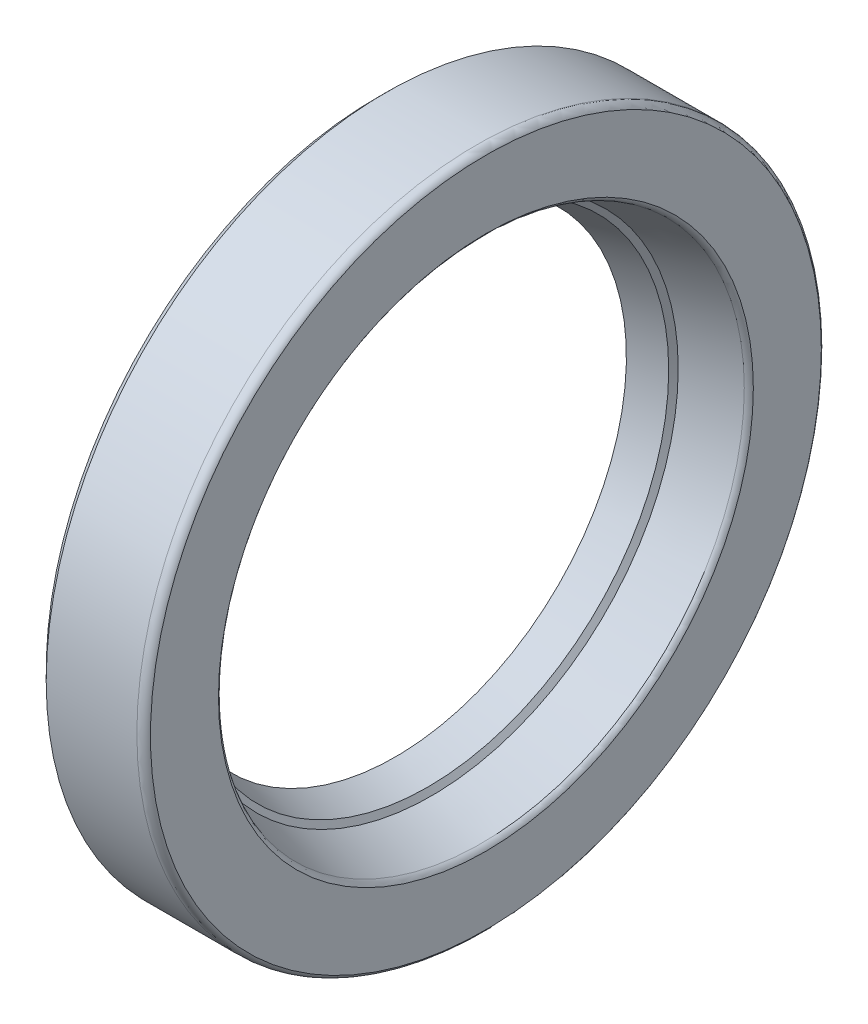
ISO-10303-21;
HEADER;
FILE_DESCRIPTION(('STEP AP214'),'2;1');
FILE_NAME('part.step','',(''),(''),'','','');
FILE_SCHEMA(('AUTOMOTIVE_DESIGN { 1 0 10303 214 1 1 1 1 }'));
ENDSEC;
DATA;
#1=APPLICATION_CONTEXT('core data for automotive mechanical design processes');
#2=APPLICATION_PROTOCOL_DEFINITION('international standard','automotive_design',2000,#1);
#3=PRODUCT_CONTEXT('',#1,'mechanical');
#4=PRODUCT('Part','Part','',(#3));
#5=PRODUCT_RELATED_PRODUCT_CATEGORY('part','',(#4));
#6=PRODUCT_DEFINITION_FORMATION('','',#4);
#7=PRODUCT_DEFINITION_CONTEXT('part definition',#1,'design');
#8=PRODUCT_DEFINITION('design','',#6,#7);
#9=PRODUCT_DEFINITION_SHAPE('','',#8);
#10=(LENGTH_UNIT() NAMED_UNIT(*) SI_UNIT(.MILLI.,.METRE.));
#11=(NAMED_UNIT(*) PLANE_ANGLE_UNIT() SI_UNIT($,.RADIAN.));
#12=(NAMED_UNIT(*) SI_UNIT($,.STERADIAN.) SOLID_ANGLE_UNIT());
#13=UNCERTAINTY_MEASURE_WITH_UNIT(LENGTH_MEASURE(1.E-05),#10,'distance_accuracy_value','');
#14=(GEOMETRIC_REPRESENTATION_CONTEXT(3) GLOBAL_UNCERTAINTY_ASSIGNED_CONTEXT((#13)) GLOBAL_UNIT_ASSIGNED_CONTEXT((#10,
#11,#12)) REPRESENTATION_CONTEXT('',''));
#15=CARTESIAN_POINT('',(0.,0.,0.));
#16=DIRECTION('',(0.,0.,1.));
#17=DIRECTION('',(1.,0.,0.));
#18=AXIS2_PLACEMENT_3D('',#15,#16,#17);
#19=CARTESIAN_POINT('',(1.,0.,0.));
#20=DIRECTION('',(1.,0.,0.));
#21=DIRECTION('',(0.,0.,-1.));
#22=AXIS2_PLACEMENT_3D('',#19,#20,#21);
#23=TOROIDAL_SURFACE('',#22,9.5,0.5);
#24=CARTESIAN_POINT('',(0.782055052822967,0.,0.));
#25=DIRECTION('',(1.,0.,0.));
#26=DIRECTION('',(0.,0.,-1.));
#27=AXIS2_PLACEMENT_3D('',#24,#25,#26);
#28=CIRCLE('',#27,9.95);
#29=CARTESIAN_POINT('',(0.782055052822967,0.,-9.95));
#30=VERTEX_POINT('',#29);
#31=EDGE_CURVE('E53',#30,#30,#28,.F.);
#32=ORIENTED_EDGE('',*,*,#31,.F.);
#33=EDGE_LOOP('',(#32));
#34=FACE_BOUND('',#33,.T.);
#35=CARTESIAN_POINT('',(1.48640310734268,0.,0.));
#36=DIRECTION('',(1.,0.,0.));
#37=DIRECTION('',(0.,1.,0.));
#38=AXIS2_PLACEMENT_3D('',#35,#36,#37);
#39=CIRCLE('',#38,9.61581026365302);
#40=CARTESIAN_POINT('',(1.48640310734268,9.61581026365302,0.));
#41=VERTEX_POINT('',#40);
#42=EDGE_CURVE('E30',#41,#41,#39,.T.);
#43=ORIENTED_EDGE('',*,*,#42,.F.);
#44=EDGE_LOOP('',(#43));
#45=FACE_BOUND('',#44,.T.);
#46=ADVANCED_FACE('F14',(#34,#45),#23,.T.);
#47=CARTESIAN_POINT('',(2.4,0.,0.));
#48=DIRECTION('',(1.,0.,0.));
#49=DIRECTION('',(0.,0.,-1.));
#50=AXIS2_PLACEMENT_3D('',#47,#48,#49);
#51=CONICAL_SURFACE('',#50,9.83333333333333,0.233743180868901);
#52=CARTESIAN_POINT('',(2.4,0.,0.));
#53=DIRECTION('',(1.,0.,0.));
#54=DIRECTION('',(0.,0.,-1.));
#55=AXIS2_PLACEMENT_3D('',#52,#53,#54);
#56=CIRCLE('',#55,9.83333333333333);
#57=CARTESIAN_POINT('',(2.4,0.,-9.83333333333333));
#58=VERTEX_POINT('',#57);
#59=EDGE_CURVE('E18',#58,#58,#56,.T.);
#60=ORIENTED_EDGE('',*,*,#59,.F.);
#61=EDGE_LOOP('',(#60));
#62=FACE_BOUND('',#61,.T.);
#63=ORIENTED_EDGE('',*,*,#42,.T.);
#64=EDGE_LOOP('',(#63));
#65=FACE_BOUND('',#64,.T.);
#66=ADVANCED_FACE('F152',(#62,#65),#51,.T.);
#67=CARTESIAN_POINT('',(0.524360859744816,0.,0.));
#68=DIRECTION('',(1.,0.,0.));
#69=DIRECTION('',(0.,0.,-1.));
#70=AXIS2_PLACEMENT_3D('',#67,#68,#69);
#71=CYLINDRICAL_SURFACE('',#70,9.95);
#72=ORIENTED_EDGE('',*,*,#31,.T.);
#73=EDGE_LOOP('',(#72));
#74=FACE_BOUND('',#73,.T.);
#75=CARTESIAN_POINT('',(0.266666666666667,0.,0.));
#76=DIRECTION('',(1.,0.,0.));
#77=DIRECTION('',(0.,0.,-1.));
#78=AXIS2_PLACEMENT_3D('',#75,#76,#77);
#79=CIRCLE('',#78,9.95);
#80=CARTESIAN_POINT('',(0.266666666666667,0.,-9.95));
#81=VERTEX_POINT('',#80);
#82=EDGE_CURVE('E48',#81,#81,#79,.F.);
#83=ORIENTED_EDGE('',*,*,#82,.F.);
#84=EDGE_LOOP('',(#83));
#85=FACE_BOUND('',#84,.T.);
#86=ADVANCED_FACE('F149',(#74,#85),#71,.T.);
#87=CARTESIAN_POINT('',(2.4,10.5833333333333,0.));
#88=DIRECTION('',(-1.,0.,0.));
#89=DIRECTION('',(0.,0.,1.));
#90=AXIS2_PLACEMENT_3D('',#87,#88,#89);
#91=PLANE('',#90);
#92=ORIENTED_EDGE('',*,*,#59,.T.);
#93=EDGE_LOOP('',(#92));
#94=FACE_BOUND('',#93,.T.);
#95=CARTESIAN_POINT('',(2.4,0.,0.));
#96=DIRECTION('',(1.,0.,0.));
#97=DIRECTION('',(0.,0.,-1.));
#98=AXIS2_PLACEMENT_3D('',#95,#96,#97);
#99=CIRCLE('',#98,11.3333333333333);
#100=CARTESIAN_POINT('',(2.4,0.,-11.3333333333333));
#101=VERTEX_POINT('',#100);
#102=EDGE_CURVE('E46',#101,#101,#99,.T.);
#103=ORIENTED_EDGE('',*,*,#102,.F.);
#104=EDGE_LOOP('',(#103));
#105=FACE_BOUND('',#104,.T.);
#106=ADVANCED_FACE('F145',(#94,#105),#91,.T.);
#107=CARTESIAN_POINT('',(0.266666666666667,9.51071428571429,0.));
#108=DIRECTION('',(-1.,0.,0.));
#109=DIRECTION('',(0.,0.,1.));
#110=AXIS2_PLACEMENT_3D('',#107,#108,#109);
#111=PLANE('',#110);
#112=CARTESIAN_POINT('',(0.266666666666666,0.,0.));
#113=DIRECTION('',(-1.,0.,0.));
#114=DIRECTION('',(0.,0.,1.));
#115=AXIS2_PLACEMENT_3D('',#112,#113,#114);
#116=CIRCLE('',#115,9.07142857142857);
#117=CARTESIAN_POINT('',(0.266666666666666,0.,9.07142857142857));
#118=VERTEX_POINT('',#117);
#119=EDGE_CURVE('E42',#118,#118,#116,.T.);
#120=ORIENTED_EDGE('',*,*,#119,.F.);
#121=EDGE_LOOP('',(#120));
#122=FACE_BOUND('',#121,.T.);
#123=ORIENTED_EDGE('',*,*,#82,.T.);
#124=EDGE_LOOP('',(#123));
#125=FACE_BOUND('',#124,.T.);
#126=ADVANCED_FACE('F99',(#122,#125),#111,.T.);
#127=CARTESIAN_POINT('',(2.09618739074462,0.,0.));
#128=DIRECTION('',(1.,0.,0.));
#129=DIRECTION('',(0.,0.,-1.));
#130=AXIS2_PLACEMENT_3D('',#127,#128,#129);
#131=TOROIDAL_SURFACE('',#130,11.1961873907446,0.333333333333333);
#132=ORIENTED_EDGE('',*,*,#102,.T.);
#133=EDGE_LOOP('',(#132));
#134=FACE_BOUND('',#133,.T.);
#135=CARTESIAN_POINT('',(2.23333333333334,0.,0.));
#136=DIRECTION('',(-1.,0.,0.));
#137=DIRECTION('',(0.,1.,0.));
#138=AXIS2_PLACEMENT_3D('',#135,#136,#137);
#139=CIRCLE('',#138,11.5);
#140=CARTESIAN_POINT('',(2.23333333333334,11.5,0.));
#141=VERTEX_POINT('',#140);
#142=EDGE_CURVE('E45',#141,#141,#139,.F.);
#143=ORIENTED_EDGE('',*,*,#142,.F.);
#144=EDGE_LOOP('',(#143));
#145=FACE_BOUND('',#144,.T.);
#146=ADVANCED_FACE('F94',(#134,#145),#131,.F.);
#147=CARTESIAN_POINT('',(0.666666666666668,0.,0.));
#148=DIRECTION('',(-1.,0.,0.));
#149=DIRECTION('',(0.,0.,1.));
#150=AXIS2_PLACEMENT_3D('',#147,#148,#149);
#151=CONICAL_SURFACE('',#150,8.5,0.960070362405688);
#152=ORIENTED_EDGE('',*,*,#119,.T.);
#153=EDGE_LOOP('',(#152));
#154=FACE_BOUND('',#153,.T.);
#155=CARTESIAN_POINT('',(0.666666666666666,0.,0.));
#156=DIRECTION('',(1.,0.,0.));
#157=DIRECTION('',(0.,1.,0.));
#158=AXIS2_PLACEMENT_3D('',#155,#156,#157);
#159=CIRCLE('',#158,8.5);
#160=CARTESIAN_POINT('',(0.666666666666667,8.5,0.));
#161=VERTEX_POINT('',#160);
#162=EDGE_CURVE('E41',#161,#161,#159,.F.);
#163=ORIENTED_EDGE('',*,*,#162,.F.);
#164=EDGE_LOOP('',(#163));
#165=FACE_BOUND('',#164,.T.);
#166=ADVANCED_FACE('F98',(#154,#165),#151,.F.);
#167=CARTESIAN_POINT('',(2.23333333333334,0.,0.));
#168=DIRECTION('',(-1.,0.,0.));
#169=DIRECTION('',(0.,0.,1.));
#170=AXIS2_PLACEMENT_3D('',#167,#168,#169);
#171=CONICAL_SURFACE('',#170,11.5,0.0893139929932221);
#172=CARTESIAN_POINT('',(0.,0.,0.));
#173=DIRECTION('',(-1.,0.,0.));
#174=DIRECTION('',(0.,0.,1.));
#175=AXIS2_PLACEMENT_3D('',#172,#173,#174);
#176=CIRCLE('',#175,11.7);
#177=CARTESIAN_POINT('',(0.,0.,11.7));
#178=VERTEX_POINT('',#177);
#179=EDGE_CURVE('E38',#178,#178,#176,.F.);
#180=ORIENTED_EDGE('',*,*,#179,.F.);
#181=EDGE_LOOP('',(#180));
#182=FACE_BOUND('',#181,.T.);
#183=ORIENTED_EDGE('',*,*,#142,.T.);
#184=EDGE_LOOP('',(#183));
#185=FACE_BOUND('',#184,.T.);
#186=ADVANCED_FACE('F104',(#182,#185),#171,.F.);
#187=CARTESIAN_POINT('',(0.666666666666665,0.,0.));
#188=DIRECTION('',(1.,0.,0.));
#189=DIRECTION('',(0.,0.,-1.));
#190=AXIS2_PLACEMENT_3D('',#187,#188,#189);
#191=CONICAL_SURFACE('',#190,8.5,0.288055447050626);
#192=ORIENTED_EDGE('',*,*,#162,.T.);
#193=EDGE_LOOP('',(#192));
#194=FACE_BOUND('',#193,.T.);
#195=CARTESIAN_POINT('',(1.86666666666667,0.,0.));
#196=DIRECTION('',(1.,0.,0.));
#197=DIRECTION('',(0.,1.,0.));
#198=AXIS2_PLACEMENT_3D('',#195,#196,#197);
#199=CIRCLE('',#198,8.85555555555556);
#200=CARTESIAN_POINT('',(1.86666666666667,8.85555555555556,0.));
#201=VERTEX_POINT('',#200);
#202=EDGE_CURVE('E37',#201,#201,#199,.F.);
#203=ORIENTED_EDGE('',*,*,#202,.F.);
#204=EDGE_LOOP('',(#203));
#205=FACE_BOUND('',#204,.T.);
#206=ADVANCED_FACE('F108',(#194,#205),#191,.F.);
#207=CARTESIAN_POINT('',(0.,11.9333333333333,0.));
#208=DIRECTION('',(-1.,0.,0.));
#209=DIRECTION('',(0.,0.,1.));
#210=AXIS2_PLACEMENT_3D('',#207,#208,#209);
#211=PLANE('',#210);
#212=ORIENTED_EDGE('',*,*,#179,.T.);
#213=EDGE_LOOP('',(#212));
#214=FACE_BOUND('',#213,.T.);
#215=CARTESIAN_POINT('',(0.,0.,0.));
#216=DIRECTION('',(1.,0.,0.));
#217=DIRECTION('',(0.,0.,-1.));
#218=AXIS2_PLACEMENT_3D('',#215,#216,#217);
#219=CIRCLE('',#218,12.1666666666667);
#220=CARTESIAN_POINT('',(0.,0.,-12.1666666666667));
#221=VERTEX_POINT('',#220);
#222=EDGE_CURVE('E33',#221,#221,#219,.T.);
#223=ORIENTED_EDGE('',*,*,#222,.F.);
#224=EDGE_LOOP('',(#223));
#225=FACE_BOUND('',#224,.T.);
#226=ADVANCED_FACE('F112',(#214,#225),#211,.T.);
#227=CARTESIAN_POINT('',(1.86666666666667,0.,0.));
#228=DIRECTION('',(1.,0.,0.));
#229=DIRECTION('',(0.,0.,-1.));
#230=AXIS2_PLACEMENT_3D('',#227,#228,#229);
#231=CONICAL_SURFACE('',#230,8.85555555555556,1.0175020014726);
#232=ORIENTED_EDGE('',*,*,#202,.T.);
#233=EDGE_LOOP('',(#232));
#234=FACE_BOUND('',#233,.T.);
#235=CARTESIAN_POINT('',(2.,0.,0.));
#236=DIRECTION('',(1.,0.,0.));
#237=DIRECTION('',(0.,1.,0.));
#238=AXIS2_PLACEMENT_3D('',#235,#236,#237);
#239=CIRCLE('',#238,9.07142857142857);
#240=CARTESIAN_POINT('',(2.,9.07142857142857,0.));
#241=VERTEX_POINT('',#240);
#242=EDGE_CURVE('E36',#241,#241,#239,.F.);
#243=ORIENTED_EDGE('',*,*,#242,.F.);
#244=EDGE_LOOP('',(#243));
#245=FACE_BOUND('',#244,.T.);
#246=ADVANCED_FACE('F116',(#234,#245),#231,.F.);
#247=CARTESIAN_POINT('',(0.333333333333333,0.,0.));
#248=DIRECTION('',(1.,0.,0.));
#249=DIRECTION('',(0.,0.,-1.));
#250=AXIS2_PLACEMENT_3D('',#247,#248,#249);
#251=CONICAL_SURFACE('',#250,12.5,0.785398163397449);
#252=CARTESIAN_POINT('',(0.333333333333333,0.,0.));
#253=DIRECTION('',(1.,0.,0.));
#254=DIRECTION('',(0.,0.,-1.));
#255=AXIS2_PLACEMENT_3D('',#252,#253,#254);
#256=CIRCLE('',#255,12.5);
#257=CARTESIAN_POINT('',(0.333333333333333,0.,-12.5));
#258=VERTEX_POINT('',#257);
#259=EDGE_CURVE('E65',#258,#258,#256,.T.);
#260=ORIENTED_EDGE('',*,*,#259,.F.);
#261=EDGE_LOOP('',(#260));
#262=FACE_BOUND('',#261,.T.);
#263=ORIENTED_EDGE('',*,*,#222,.T.);
#264=EDGE_LOOP('',(#263));
#265=FACE_BOUND('',#264,.T.);
#266=ADVANCED_FACE('F120',(#262,#265),#251,.T.);
#267=CARTESIAN_POINT('',(2.,0.,0.));
#268=DIRECTION('',(1.,0.,0.));
#269=DIRECTION('',(0.,0.,-1.));
#270=AXIS2_PLACEMENT_3D('',#267,#268,#269);
#271=CONICAL_SURFACE('',#270,9.07142857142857,0.313938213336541);
#272=ORIENTED_EDGE('',*,*,#242,.T.);
#273=EDGE_LOOP('',(#272));
#274=FACE_BOUND('',#273,.T.);
#275=CARTESIAN_POINT('',(3.83333333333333,0.,0.));
#276=DIRECTION('',(1.,0.,0.));
#277=DIRECTION('',(0.,0.,-1.));
#278=AXIS2_PLACEMENT_3D('',#275,#276,#277);
#279=CIRCLE('',#278,9.66666666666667);
#280=CARTESIAN_POINT('',(3.83333333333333,0.,-9.66666666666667));
#281=VERTEX_POINT('',#280);
#282=EDGE_CURVE('E68',#281,#281,#279,.F.);
#283=ORIENTED_EDGE('',*,*,#282,.F.);
#284=EDGE_LOOP('',(#283));
#285=FACE_BOUND('',#284,.T.);
#286=ADVANCED_FACE('F123',(#274,#285),#271,.F.);
#287=CARTESIAN_POINT('',(2.,0.,0.));
#288=DIRECTION('',(1.,0.,0.));
#289=DIRECTION('',(0.,0.,-1.));
#290=AXIS2_PLACEMENT_3D('',#287,#288,#289);
#291=CYLINDRICAL_SURFACE('',#290,12.5);
#292=CARTESIAN_POINT('',(3.66666666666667,0.,0.));
#293=DIRECTION('',(1.,0.,0.));
#294=DIRECTION('',(0.,0.,-1.));
#295=AXIS2_PLACEMENT_3D('',#292,#293,#294);
#296=CIRCLE('',#295,12.5);
#297=CARTESIAN_POINT('',(3.66666666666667,0.,-12.5));
#298=VERTEX_POINT('',#297);
#299=EDGE_CURVE('E27',#298,#298,#296,.T.);
#300=ORIENTED_EDGE('',*,*,#299,.F.);
#301=EDGE_LOOP('',(#300));
#302=FACE_BOUND('',#301,.T.);
#303=ORIENTED_EDGE('',*,*,#259,.T.);
#304=EDGE_LOOP('',(#303));
#305=FACE_BOUND('',#304,.T.);
#306=ADVANCED_FACE('F81',(#302,#305),#291,.T.);
#307=CARTESIAN_POINT('',(3.69618739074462,0.,0.));
#308=DIRECTION('',(1.,0.,0.));
#309=DIRECTION('',(0.,0.,-1.));
#310=AXIS2_PLACEMENT_3D('',#307,#308,#309);
#311=TOROIDAL_SURFACE('',#310,9.97047927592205,0.333333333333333);
#312=CARTESIAN_POINT('',(4.,0.,0.));
#313=DIRECTION('',(1.,0.,0.));
#314=DIRECTION('',(0.,0.,-1.));
#315=AXIS2_PLACEMENT_3D('',#312,#313,#314);
#316=CIRCLE('',#315,9.83333333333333);
#317=CARTESIAN_POINT('',(4.,0.,-9.83333333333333));
#318=VERTEX_POINT('',#317);
#319=EDGE_CURVE('E22',#318,#318,#316,.F.);
#320=ORIENTED_EDGE('',*,*,#319,.F.);
#321=EDGE_LOOP('',(#320));
#322=FACE_BOUND('',#321,.T.);
#323=ORIENTED_EDGE('',*,*,#282,.T.);
#324=EDGE_LOOP('',(#323));
#325=FACE_BOUND('',#324,.T.);
#326=ADVANCED_FACE('F77',(#322,#325),#311,.T.);
#327=CARTESIAN_POINT('',(3.70973002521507,0.,0.));
#328=DIRECTION('',(1.,0.,0.));
#329=DIRECTION('',(0.,0.,-1.));
#330=AXIS2_PLACEMENT_3D('',#327,#328,#329);
#331=TOROIDAL_SURFACE('',#330,12.1694600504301,0.333333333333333);
#332=ORIENTED_EDGE('',*,*,#299,.T.);
#333=EDGE_LOOP('',(#332));
#334=FACE_BOUND('',#333,.T.);
#335=CARTESIAN_POINT('',(4.,0.,0.));
#336=DIRECTION('',(1.,0.,0.));
#337=DIRECTION('',(0.,0.,-1.));
#338=AXIS2_PLACEMENT_3D('',#335,#336,#337);
#339=CIRCLE('',#338,12.3333333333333);
#340=CARTESIAN_POINT('',(4.,0.,-12.3333333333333));
#341=VERTEX_POINT('',#340);
#342=EDGE_CURVE('E9',#341,#341,#339,.T.);
#343=ORIENTED_EDGE('',*,*,#342,.F.);
#344=EDGE_LOOP('',(#343));
#345=FACE_BOUND('',#344,.T.);
#346=ADVANCED_FACE('F74',(#334,#345),#331,.T.);
#347=CARTESIAN_POINT('',(4.,11.0833333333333,0.));
#348=DIRECTION('',(1.,0.,0.));
#349=DIRECTION('',(0.,0.,-1.));
#350=AXIS2_PLACEMENT_3D('',#347,#348,#349);
#351=PLANE('',#350);
#352=ORIENTED_EDGE('',*,*,#342,.T.);
#353=EDGE_LOOP('',(#352));
#354=FACE_BOUND('',#353,.T.);
#355=ORIENTED_EDGE('',*,*,#319,.T.);
#356=EDGE_LOOP('',(#355));
#357=FACE_BOUND('',#356,.T.);
#358=ADVANCED_FACE('F16',(#354,#357),#351,.T.);
#359=CLOSED_SHELL('',(#46,#66,#86,#106,#126,#146,#166,#186,#206,#226,#246,#266,#286,#306,#326,
#346,#358));
#360=MANIFOLD_SOLID_BREP('B1',#359);
#361=ADVANCED_BREP_SHAPE_REPRESENTATION('',(#18,#360),#14);
#362=SHAPE_DEFINITION_REPRESENTATION(#9,#361);
ENDSEC;
END-ISO-10303-21;
